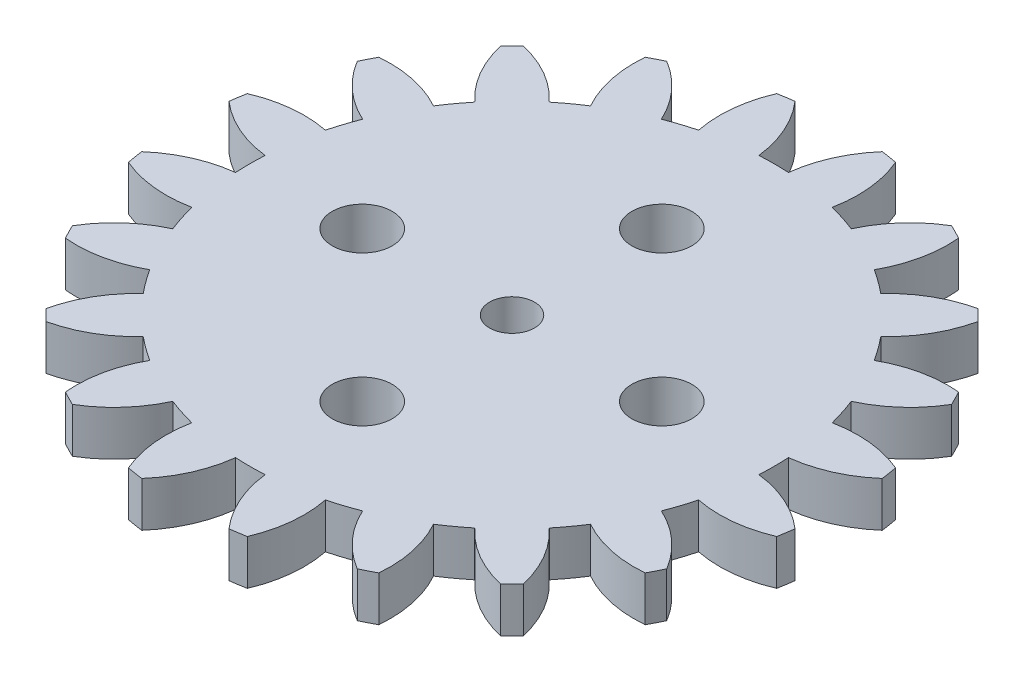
from build123d import *

# Parameters (mm, degrees)
EXTRUDE_1_DEPTH     = 3
SKETCH_2_R          = 1.5
CUT_EXTRUDE_1_DEPTH = 3
SKETCH_3_R          = 2
CUT_EXTRUDE_2_DEPTH = 10


with BuildPart() as part:
    # Sketch 1 → Extrude 1 (new body)
    with BuildSketch(Plane(origin=(0, 0, 0), x_dir=(1, 0, 0), z_dir=(0, 1, 0))):
        with BuildLine():
            ThreePointArc((-33.75984534, 23.831341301), (-31.7383595, 22.539349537), (-29.424701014, 21.904816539))
            ThreePointArc((-29.424701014, 21.904816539), (-29.452511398, 20.918644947), (-29.424701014, 19.932473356))
            ThreePointArc((-29.424701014, 19.932473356), (-31.7383595, 19.297940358), (-33.75984534, 18.005948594))
            ThreePointArc((-33.75984534, 18.005948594), (-33.682654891, 17.477086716), (-33.592640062, 16.950256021))
            ThreePointArc((-33.592640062, 16.950256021), (-31.270845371, 16.346172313), (-28.874343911, 16.457655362))
            ThreePointArc((-28.874343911, 16.457655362), (-28.596049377, 15.511156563), (-28.264856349, 14.581845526))
            ThreePointArc((-28.264856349, 14.581845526), (-30.269194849, 13.263408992), (-31.792494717, 11.409978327))
            ThreePointArc((-31.792494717, 11.409978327), (-31.555654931, 10.930853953), (-31.307246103, 10.457624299))
            ThreePointArc((-31.307246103, 10.457624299), (-28.912416, 10.60058057), (-26.667657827, 11.447166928))
            ThreePointArc((-26.667657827, 11.447166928), (-26.110499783, 10.632990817), (-25.508343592, 9.851507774))
            ThreePointArc((-25.508343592, 9.851507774), (-27.007163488, 7.978225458), (-27.883166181, 5.744782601))
            ThreePointArc((-27.883166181, 5.744782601), (-27.509860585, 5.362295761), (-27.127373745, 4.988990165))
            ThreePointArc((-27.127373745, 4.988990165), (-24.893930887, 5.864992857), (-23.020648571, 7.363812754))
            ThreePointArc((-23.020648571, 7.363812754), (-22.239165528, 6.761656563), (-21.424989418, 6.204498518))
            ThreePointArc((-21.424989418, 6.204498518), (-22.271575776, 3.959740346), (-22.414532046, 1.564910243))
            ThreePointArc((-22.414532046, 1.564910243), (-21.941302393, 1.316501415), (-21.462178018, 1.079661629))
            ThreePointArc((-21.462178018, 1.079661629), (-19.608747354, 2.602961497), (-18.29031082, 4.607299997))
            ThreePointArc((-18.29031082, 4.607299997), (-17.360999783, 4.276106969), (-16.414500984, 3.997812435))
            ThreePointArc((-16.414500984, 3.997812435), (-16.525984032, 1.601310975), (-15.921900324, -0.720483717))
            ThreePointArc((-15.921900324, -0.720483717), (-15.395069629, -0.810498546), (-14.866207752, -0.887688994))
            ThreePointArc((-14.866207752, -0.887688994), (-13.574215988, 1.133796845), (-12.93968299, 3.447455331))
            ThreePointArc((-12.93968299, 3.447455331), (-11.953511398, 3.419644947), (-10.967339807, 3.447455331))
            ThreePointArc((-10.967339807, 3.447455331), (-10.332806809, 1.133796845), (-9.040815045, -0.887688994))
            ThreePointArc((-9.040815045, -0.887688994), (-8.511953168, -0.810498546), (-7.985122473, -0.720483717))
            ThreePointArc((-7.985122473, -0.720483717), (-7.381038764, 1.601310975), (-7.492521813, 3.997812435))
            ThreePointArc((-7.492521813, 3.997812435), (-6.546023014, 4.276106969), (-5.616711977, 4.607299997))
            ThreePointArc((-5.616711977, 4.607299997), (-4.298275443, 2.602961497), (-2.444844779, 1.079661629))
            ThreePointArc((-2.444844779, 1.079661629), (-1.965720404, 1.316501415), (-1.492490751, 1.564910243))
            ThreePointArc((-1.492490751, 1.564910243), (-1.635447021, 3.959740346), (-2.482033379, 6.204498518))
            ThreePointArc((-2.482033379, 6.204498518), (-1.667857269, 6.761656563), (-0.886374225, 7.363812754))
            ThreePointArc((-0.886374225, 7.363812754), (0.98690809, 5.864992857), (3.220350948, 4.988990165))
            ThreePointArc((3.220350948, 4.988990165), (3.602837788, 5.362295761), (3.976143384, 5.744782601))
            ThreePointArc((3.976143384, 5.744782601), (3.100140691, 7.978225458), (1.601320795, 9.851507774))
            ThreePointArc((1.601320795, 9.851507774), (2.203476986, 10.632990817), (2.76063503, 11.447166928))
            ThreePointArc((2.76063503, 11.447166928), (5.005393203, 10.60058057), (7.400223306, 10.457624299))
            ThreePointArc((7.400223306, 10.457624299), (7.648632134, 10.930853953), (7.88547192, 11.409978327))
            ThreePointArc((7.88547192, 11.409978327), (6.362172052, 13.263408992), (4.357833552, 14.581845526))
            ThreePointArc((4.357833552, 14.581845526), (4.68902658, 15.511156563), (4.967321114, 16.457655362))
            ThreePointArc((4.967321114, 16.457655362), (7.363822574, 16.346172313), (9.685617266, 16.950256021))
            ThreePointArc((9.685617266, 16.950256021), (9.775632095, 17.477086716), (9.852822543, 18.005948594))
            ThreePointArc((9.852822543, 18.005948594), (7.831336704, 19.297940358), (5.517678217, 19.932473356))
            ThreePointArc((5.517678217, 19.932473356), (5.545488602, 20.918644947), (5.517678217, 21.904816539))
            ThreePointArc((5.517678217, 21.904816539), (7.831336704, 22.539349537), (9.852822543, 23.831341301))
            ThreePointArc((9.852822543, 23.831341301), (9.775632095, 24.360203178), (9.685617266, 24.887033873))
            ThreePointArc((9.685617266, 24.887033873), (7.363822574, 25.491117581), (4.967321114, 25.379634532))
            ThreePointArc((4.967321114, 25.379634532), (4.68902658, 26.326133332), (4.357833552, 27.255444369))
            ThreePointArc((4.357833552, 27.255444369), (6.362172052, 28.573880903), (7.88547192, 30.427311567))
            ThreePointArc((7.88547192, 30.427311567), (7.648632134, 30.906435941), (7.400223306, 31.379665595))
            ThreePointArc((7.400223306, 31.379665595), (5.005393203, 31.236709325), (2.76063503, 30.390122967))
            ThreePointArc((2.76063503, 30.390122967), (2.203476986, 31.204299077), (1.601320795, 31.98578212))
            ThreePointArc((1.601320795, 31.98578212), (3.100140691, 33.859064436), (3.976143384, 36.092507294))
            ThreePointArc((3.976143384, 36.092507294), (3.602837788, 36.474994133), (3.220350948, 36.84829973))
            ThreePointArc((3.220350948, 36.84829973), (0.98690809, 35.972297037), (-0.886374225, 34.473477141))
            ThreePointArc((-0.886374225, 34.473477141), (-1.667857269, 35.075633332), (-2.482033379, 35.632791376))
            ThreePointArc((-2.482033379, 35.632791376), (-1.635447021, 37.877549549), (-1.492490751, 40.272379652))
            ThreePointArc((-1.492490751, 40.272379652), (-1.965720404, 40.520788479), (-2.444844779, 40.757628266))
            ThreePointArc((-2.444844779, 40.757628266), (-4.298275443, 39.234328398), (-5.616711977, 37.229989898))
            ThreePointArc((-5.616711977, 37.229989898), (-6.546023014, 37.561182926), (-7.492521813, 37.83947746))
            ThreePointArc((-7.492521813, 37.83947746), (-7.381038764, 40.23597892), (-7.985122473, 42.557773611))
            ThreePointArc((-7.985122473, 42.557773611), (-8.511953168, 42.64778844), (-9.040815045, 42.724978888))
            ThreePointArc((-9.040815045, 42.724978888), (-10.332806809, 40.703493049), (-10.967339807, 38.389834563))
            ThreePointArc((-10.967339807, 38.389834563), (-11.953511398, 38.417644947), (-12.93968299, 38.389834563))
            ThreePointArc((-12.93968299, 38.389834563), (-13.574215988, 40.703493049), (-14.866207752, 42.724978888))
            ThreePointArc((-14.866207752, 42.724978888), (-15.395069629, 42.64778844), (-15.921900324, 42.557773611))
            ThreePointArc((-15.921900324, 42.557773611), (-16.525984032, 40.23597892), (-16.414500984, 37.83947746))
            ThreePointArc((-16.414500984, 37.83947746), (-17.360999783, 37.561182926), (-18.29031082, 37.229989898))
            ThreePointArc((-18.29031082, 37.229989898), (-19.608747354, 39.234328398), (-21.462178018, 40.757628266))
            ThreePointArc((-21.462178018, 40.757628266), (-21.941302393, 40.520788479), (-22.414532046, 40.272379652))
            ThreePointArc((-22.414532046, 40.272379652), (-22.271575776, 37.877549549), (-21.424989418, 35.632791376))
            ThreePointArc((-21.424989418, 35.632791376), (-22.239165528, 35.075633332), (-23.020648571, 34.473477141))
            ThreePointArc((-23.020648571, 34.473477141), (-24.893930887, 35.972297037), (-27.127373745, 36.84829973))
            ThreePointArc((-27.127373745, 36.84829973), (-27.509860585, 36.474994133), (-27.883166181, 36.092507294))
            ThreePointArc((-27.883166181, 36.092507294), (-27.007163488, 33.859064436), (-25.508343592, 31.98578212))
            ThreePointArc((-25.508343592, 31.98578212), (-26.110499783, 31.204299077), (-26.667657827, 30.390122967))
            ThreePointArc((-26.667657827, 30.390122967), (-28.912416, 31.236709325), (-31.307246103, 31.379665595))
            ThreePointArc((-31.307246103, 31.379665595), (-31.555654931, 30.906435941), (-31.792494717, 30.427311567))
            ThreePointArc((-31.792494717, 30.427311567), (-30.269194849, 28.573880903), (-28.264856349, 27.255444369))
            ThreePointArc((-28.264856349, 27.255444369), (-28.596049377, 26.326133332), (-28.874343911, 25.379634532))
            ThreePointArc((-28.874343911, 25.379634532), (-31.270845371, 25.491117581), (-33.592640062, 24.887033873))
            ThreePointArc((-33.592640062, 24.887033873), (-33.682654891, 24.360203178), (-33.75984534, 23.831341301))
        make_face()
    extrude(amount=EXTRUDE_1_DEPTH)

    # Sketch 2 → Cut-Extrude 1 (cut)
    with BuildSketch(Plane(origin=(0, 3, 0), x_dir=(1, 0, 0), z_dir=(0, 1, 0))):
        with Locations(Location((-11.953511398, 20.918644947, 0), (0, 0, 270))):
            Circle(SKETCH_2_R)
    extrude(amount=-CUT_EXTRUDE_1_DEPTH, mode=Mode.SUBTRACT)

    # Sketch 3 → Cut-Extrude 2 (cut)
    with BuildSketch(Plane(origin=(0, 3, 0), x_dir=(1, 0, 0), z_dir=(0, 1, 0))):
        with Locations(Location((-11.953511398, 30.918644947, 0), (0, 0, 270))):
            Circle(SKETCH_3_R)
        with Locations(Location((-1.953511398, 20.918644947, 0), (0, 0, 270))):
            Circle(SKETCH_3_R)
        with Locations(Location((-11.953511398, 10.918644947, 0), (0, 0, 270))):
            Circle(SKETCH_3_R)
        with Locations(Location((-21.953511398, 20.918644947, 0), (0, 0, 270))):
            Circle(SKETCH_3_R)
    extrude(amount=-CUT_EXTRUDE_2_DEPTH, mode=Mode.SUBTRACT)


solid = part.part
